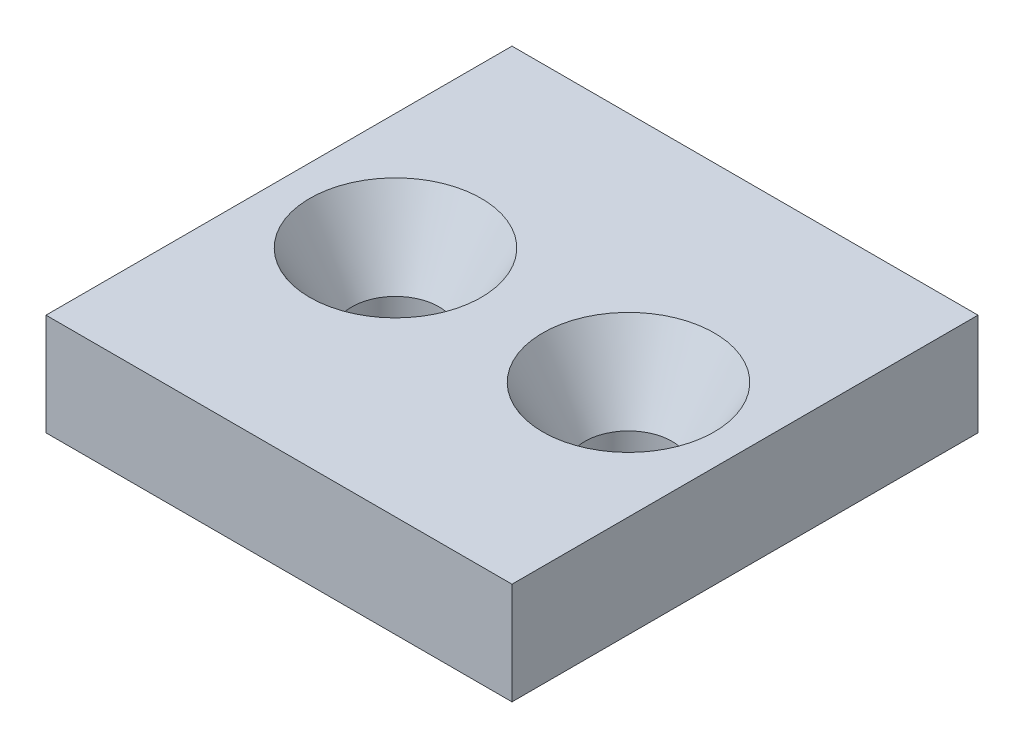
ISO-10303-21;
HEADER;
FILE_DESCRIPTION(('STEP AP214'),'2;1');
FILE_NAME('part.step','',(''),(''),'','','');
FILE_SCHEMA(('AUTOMOTIVE_DESIGN { 1 0 10303 214 1 1 1 1 }'));
ENDSEC;
DATA;
#1=APPLICATION_CONTEXT('core data for automotive mechanical design processes');
#2=APPLICATION_PROTOCOL_DEFINITION('international standard','automotive_design',2000,#1);
#3=PRODUCT_CONTEXT('',#1,'mechanical');
#4=PRODUCT('Part','Part','',(#3));
#5=PRODUCT_RELATED_PRODUCT_CATEGORY('part','',(#4));
#6=PRODUCT_DEFINITION_FORMATION('','',#4);
#7=PRODUCT_DEFINITION_CONTEXT('part definition',#1,'design');
#8=PRODUCT_DEFINITION('design','',#6,#7);
#9=PRODUCT_DEFINITION_SHAPE('','',#8);
#10=(LENGTH_UNIT() NAMED_UNIT(*) SI_UNIT(.MILLI.,.METRE.));
#11=(NAMED_UNIT(*) PLANE_ANGLE_UNIT() SI_UNIT($,.RADIAN.));
#12=(NAMED_UNIT(*) SI_UNIT($,.STERADIAN.) SOLID_ANGLE_UNIT());
#13=UNCERTAINTY_MEASURE_WITH_UNIT(LENGTH_MEASURE(1.E-05),#10,'distance_accuracy_value','');
#14=(GEOMETRIC_REPRESENTATION_CONTEXT(3) GLOBAL_UNCERTAINTY_ASSIGNED_CONTEXT((#13)) GLOBAL_UNIT_ASSIGNED_CONTEXT((#10,
#11,#12)) REPRESENTATION_CONTEXT('',''));
#15=CARTESIAN_POINT('',(0.,0.,0.));
#16=DIRECTION('',(0.,0.,1.));
#17=DIRECTION('',(1.,0.,0.));
#18=AXIS2_PLACEMENT_3D('',#15,#16,#17);
#19=CARTESIAN_POINT('',(16.,7.,16.));
#20=DIRECTION('',(-1.,0.,0.));
#21=DIRECTION('',(0.,0.,1.));
#22=AXIS2_PLACEMENT_3D('',#19,#20,#21);
#23=PLANE('',#22);
#24=DIRECTION('',(0.,0.,-1.));
#25=VECTOR('',#24,1.);
#26=CARTESIAN_POINT('',(16.,0.,16.));
#27=LINE('',#26,#25);
#28=CARTESIAN_POINT('',(16.,0.,16.));
#29=VERTEX_POINT('',#28);
#30=CARTESIAN_POINT('',(16.,0.,-16.));
#31=VERTEX_POINT('',#30);
#32=EDGE_CURVE('E95',#29,#31,#27,.T.);
#33=ORIENTED_EDGE('',*,*,#32,.T.);
#34=DIRECTION('',(0.,-1.,0.));
#35=VECTOR('',#34,1.);
#36=CARTESIAN_POINT('',(16.,7.,-16.));
#37=LINE('',#36,#35);
#38=CARTESIAN_POINT('',(16.,7.,-16.));
#39=VERTEX_POINT('',#38);
#40=EDGE_CURVE('E11',#39,#31,#37,.T.);
#41=ORIENTED_EDGE('',*,*,#40,.F.);
#42=DIRECTION('',(0.,0.,-1.));
#43=VECTOR('',#42,1.);
#44=CARTESIAN_POINT('',(16.,7.,16.));
#45=LINE('',#44,#43);
#46=CARTESIAN_POINT('',(16.,7.,16.));
#47=VERTEX_POINT('',#46);
#48=EDGE_CURVE('E83',#47,#39,#45,.T.);
#49=ORIENTED_EDGE('',*,*,#48,.F.);
#50=DIRECTION('',(0.,-1.,0.));
#51=VECTOR('',#50,1.);
#52=CARTESIAN_POINT('',(16.,7.,16.));
#53=LINE('',#52,#51);
#54=EDGE_CURVE('E91',#47,#29,#53,.T.);
#55=ORIENTED_EDGE('',*,*,#54,.T.);
#56=EDGE_LOOP('',(#33,#41,#49,#55));
#57=FACE_BOUND('',#56,.T.);
#58=ADVANCED_FACE('F32',(#57),#23,.F.);
#59=CARTESIAN_POINT('',(-16.,7.,-16.));
#60=DIRECTION('',(0.,0.,1.));
#61=DIRECTION('',(1.,0.,0.));
#62=AXIS2_PLACEMENT_3D('',#59,#60,#61);
#63=PLANE('',#62);
#64=DIRECTION('',(-1.,0.,0.));
#65=VECTOR('',#64,1.);
#66=CARTESIAN_POINT('',(-16.,0.,-16.));
#67=LINE('',#66,#65);
#68=CARTESIAN_POINT('',(-16.,0.,-16.));
#69=VERTEX_POINT('',#68);
#70=EDGE_CURVE('E87',#31,#69,#67,.T.);
#71=ORIENTED_EDGE('',*,*,#70,.T.);
#72=DIRECTION('',(0.,-1.,0.));
#73=VECTOR('',#72,1.);
#74=CARTESIAN_POINT('',(-16.,7.,-16.));
#75=LINE('',#74,#73);
#76=CARTESIAN_POINT('',(-16.,7.,-16.));
#77=VERTEX_POINT('',#76);
#78=EDGE_CURVE('E40',#77,#69,#75,.T.);
#79=ORIENTED_EDGE('',*,*,#78,.F.);
#80=DIRECTION('',(-1.,0.,0.));
#81=VECTOR('',#80,1.);
#82=CARTESIAN_POINT('',(-16.,7.,-16.));
#83=LINE('',#82,#81);
#84=EDGE_CURVE('E78',#39,#77,#83,.T.);
#85=ORIENTED_EDGE('',*,*,#84,.F.);
#86=ORIENTED_EDGE('',*,*,#40,.T.);
#87=EDGE_LOOP('',(#71,#79,#85,#86));
#88=FACE_BOUND('',#87,.T.);
#89=ADVANCED_FACE('F86',(#88),#63,.F.);
#90=CARTESIAN_POINT('',(-16.,7.,16.));
#91=DIRECTION('',(1.,0.,0.));
#92=DIRECTION('',(0.,0.,-1.));
#93=AXIS2_PLACEMENT_3D('',#90,#91,#92);
#94=PLANE('',#93);
#95=DIRECTION('',(0.,0.,1.));
#96=VECTOR('',#95,1.);
#97=CARTESIAN_POINT('',(-16.,0.,16.));
#98=LINE('',#97,#96);
#99=CARTESIAN_POINT('',(-16.,0.,16.));
#100=VERTEX_POINT('',#99);
#101=EDGE_CURVE('E65',#69,#100,#98,.T.);
#102=ORIENTED_EDGE('',*,*,#101,.T.);
#103=DIRECTION('',(0.,-1.,0.));
#104=VECTOR('',#103,1.);
#105=CARTESIAN_POINT('',(-16.,7.,16.));
#106=LINE('',#105,#104);
#107=CARTESIAN_POINT('',(-16.,7.,16.));
#108=VERTEX_POINT('',#107);
#109=EDGE_CURVE('E88',#108,#100,#106,.T.);
#110=ORIENTED_EDGE('',*,*,#109,.F.);
#111=DIRECTION('',(0.,0.,1.));
#112=VECTOR('',#111,1.);
#113=CARTESIAN_POINT('',(-16.,7.,16.));
#114=LINE('',#113,#112);
#115=EDGE_CURVE('E81',#77,#108,#114,.T.);
#116=ORIENTED_EDGE('',*,*,#115,.F.);
#117=ORIENTED_EDGE('',*,*,#78,.T.);
#118=EDGE_LOOP('',(#102,#110,#116,#117));
#119=FACE_BOUND('',#118,.T.);
#120=ADVANCED_FACE('F89',(#119),#94,.F.);
#121=CARTESIAN_POINT('',(-16.,7.,16.));
#122=DIRECTION('',(0.,0.,-1.));
#123=DIRECTION('',(-1.,0.,0.));
#124=AXIS2_PLACEMENT_3D('',#121,#122,#123);
#125=PLANE('',#124);
#126=DIRECTION('',(1.,0.,0.));
#127=VECTOR('',#126,1.);
#128=CARTESIAN_POINT('',(-16.,0.,16.));
#129=LINE('',#128,#127);
#130=EDGE_CURVE('E71',#100,#29,#129,.T.);
#131=ORIENTED_EDGE('',*,*,#130,.T.);
#132=ORIENTED_EDGE('',*,*,#54,.F.);
#133=DIRECTION('',(1.,0.,0.));
#134=VECTOR('',#133,1.);
#135=CARTESIAN_POINT('',(-16.,7.,16.));
#136=LINE('',#135,#134);
#137=EDGE_CURVE('E48',#108,#47,#136,.T.);
#138=ORIENTED_EDGE('',*,*,#137,.F.);
#139=ORIENTED_EDGE('',*,*,#109,.T.);
#140=EDGE_LOOP('',(#131,#132,#138,#139));
#141=FACE_BOUND('',#140,.T.);
#142=ADVANCED_FACE('F103',(#141),#125,.F.);
#143=CARTESIAN_POINT('',(16.,7.,-16.));
#144=DIRECTION('',(0.,-1.,0.));
#145=DIRECTION('',(0.,0.,-1.));
#146=AXIS2_PLACEMENT_3D('',#143,#144,#145);
#147=PLANE('',#146);
#148=CARTESIAN_POINT('',(-8.,7.,0.));
#149=DIRECTION('',(0.,1.,0.));
#150=DIRECTION('',(0.,0.,1.));
#151=AXIS2_PLACEMENT_3D('',#148,#149,#150);
#152=CIRCLE('',#151,5.89);
#153=CARTESIAN_POINT('',(-8.,7.,5.89));
#154=VERTEX_POINT('',#153);
#155=EDGE_CURVE('E123',#154,#154,#152,.T.);
#156=ORIENTED_EDGE('',*,*,#155,.F.);
#157=EDGE_LOOP('',(#156));
#158=FACE_BOUND('',#157,.T.);
#159=CARTESIAN_POINT('',(8.,7.,0.));
#160=DIRECTION('',(0.,1.,0.));
#161=DIRECTION('',(0.,0.,1.));
#162=AXIS2_PLACEMENT_3D('',#159,#160,#161);
#163=CIRCLE('',#162,5.89);
#164=CARTESIAN_POINT('',(8.,7.,5.89));
#165=VERTEX_POINT('',#164);
#166=EDGE_CURVE('E114',#165,#165,#163,.T.);
#167=ORIENTED_EDGE('',*,*,#166,.F.);
#168=EDGE_LOOP('',(#167));
#169=FACE_BOUND('',#168,.T.);
#170=ORIENTED_EDGE('',*,*,#48,.T.);
#171=ORIENTED_EDGE('',*,*,#84,.T.);
#172=ORIENTED_EDGE('',*,*,#115,.T.);
#173=ORIENTED_EDGE('',*,*,#137,.T.);
#174=EDGE_LOOP('',(#170,#171,#172,#173));
#175=FACE_BOUND('',#174,.T.);
#176=ADVANCED_FACE('F79',(#158,#169,#175),#147,.F.);
#177=CARTESIAN_POINT('',(16.,0.,-16.));
#178=DIRECTION('',(0.,-1.,0.));
#179=DIRECTION('',(0.,0.,-1.));
#180=AXIS2_PLACEMENT_3D('',#177,#178,#179);
#181=PLANE('',#180);
#182=CARTESIAN_POINT('',(-8.,0.,0.));
#183=DIRECTION('',(0.,1.,0.));
#184=DIRECTION('',(0.,0.,1.));
#185=AXIS2_PLACEMENT_3D('',#182,#183,#184);
#186=CIRCLE('',#185,3.);
#187=CARTESIAN_POINT('',(-8.,0.,3.));
#188=VERTEX_POINT('',#187);
#189=EDGE_CURVE('E117',#188,#188,#186,.T.);
#190=ORIENTED_EDGE('',*,*,#189,.T.);
#191=EDGE_LOOP('',(#190));
#192=FACE_BOUND('',#191,.T.);
#193=CARTESIAN_POINT('',(8.,0.,0.));
#194=DIRECTION('',(0.,1.,0.));
#195=DIRECTION('',(0.,0.,1.));
#196=AXIS2_PLACEMENT_3D('',#193,#194,#195);
#197=CIRCLE('',#196,3.);
#198=CARTESIAN_POINT('',(8.,0.,3.));
#199=VERTEX_POINT('',#198);
#200=EDGE_CURVE('E98',#199,#199,#197,.T.);
#201=ORIENTED_EDGE('',*,*,#200,.T.);
#202=EDGE_LOOP('',(#201));
#203=FACE_BOUND('',#202,.T.);
#204=ORIENTED_EDGE('',*,*,#32,.F.);
#205=ORIENTED_EDGE('',*,*,#130,.F.);
#206=ORIENTED_EDGE('',*,*,#101,.F.);
#207=ORIENTED_EDGE('',*,*,#70,.F.);
#208=EDGE_LOOP('',(#204,#205,#206,#207));
#209=FACE_BOUND('',#208,.T.);
#210=ADVANCED_FACE('F106',(#192,#203,#209),#181,.T.);
#211=CARTESIAN_POINT('',(8.,7.,0.));
#212=DIRECTION('',(0.,1.,0.));
#213=DIRECTION('',(0.,0.,1.));
#214=AXIS2_PLACEMENT_3D('',#211,#212,#213);
#215=CYLINDRICAL_SURFACE('',#214,3.);
#216=ORIENTED_EDGE('',*,*,#200,.F.);
#217=EDGE_LOOP('',(#216));
#218=FACE_BOUND('',#217,.T.);
#219=CARTESIAN_POINT('',(8.,1.99437316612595,0.));
#220=DIRECTION('',(0.,1.,0.));
#221=DIRECTION('',(0.,0.,1.));
#222=AXIS2_PLACEMENT_3D('',#219,#220,#221);
#223=CIRCLE('',#222,3.);
#224=CARTESIAN_POINT('',(8.,1.99437316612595,3.));
#225=VERTEX_POINT('',#224);
#226=EDGE_CURVE('E111',#225,#225,#223,.T.);
#227=ORIENTED_EDGE('',*,*,#226,.T.);
#228=EDGE_LOOP('',(#227));
#229=FACE_BOUND('',#228,.T.);
#230=ADVANCED_FACE('F137',(#218,#229),#215,.F.);
#231=CARTESIAN_POINT('',(8.,7.,0.));
#232=DIRECTION('',(0.,1.,0.));
#233=DIRECTION('',(0.,0.,1.));
#234=AXIS2_PLACEMENT_3D('',#231,#232,#233);
#235=CONICAL_SURFACE('',#234,5.89,0.523598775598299);
#236=ORIENTED_EDGE('',*,*,#226,.F.);
#237=EDGE_LOOP('',(#236));
#238=FACE_BOUND('',#237,.T.);
#239=ORIENTED_EDGE('',*,*,#166,.T.);
#240=EDGE_LOOP('',(#239));
#241=FACE_BOUND('',#240,.T.);
#242=ADVANCED_FACE('F134',(#238,#241),#235,.F.);
#243=CARTESIAN_POINT('',(-8.,7.,0.));
#244=DIRECTION('',(0.,1.,0.));
#245=DIRECTION('',(0.,0.,1.));
#246=AXIS2_PLACEMENT_3D('',#243,#244,#245);
#247=CYLINDRICAL_SURFACE('',#246,3.);
#248=ORIENTED_EDGE('',*,*,#189,.F.);
#249=EDGE_LOOP('',(#248));
#250=FACE_BOUND('',#249,.T.);
#251=CARTESIAN_POINT('',(-8.,1.99437316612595,0.));
#252=DIRECTION('',(0.,1.,0.));
#253=DIRECTION('',(0.,0.,1.));
#254=AXIS2_PLACEMENT_3D('',#251,#252,#253);
#255=CIRCLE('',#254,3.);
#256=CARTESIAN_POINT('',(-8.,1.99437316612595,3.));
#257=VERTEX_POINT('',#256);
#258=EDGE_CURVE('E120',#257,#257,#255,.T.);
#259=ORIENTED_EDGE('',*,*,#258,.T.);
#260=EDGE_LOOP('',(#259));
#261=FACE_BOUND('',#260,.T.);
#262=ADVANCED_FACE('F136',(#250,#261),#247,.F.);
#263=CARTESIAN_POINT('',(-8.,7.,0.));
#264=DIRECTION('',(0.,1.,0.));
#265=DIRECTION('',(0.,0.,1.));
#266=AXIS2_PLACEMENT_3D('',#263,#264,#265);
#267=CONICAL_SURFACE('',#266,5.89,0.523598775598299);
#268=ORIENTED_EDGE('',*,*,#258,.F.);
#269=EDGE_LOOP('',(#268));
#270=FACE_BOUND('',#269,.T.);
#271=ORIENTED_EDGE('',*,*,#155,.T.);
#272=EDGE_LOOP('',(#271));
#273=FACE_BOUND('',#272,.T.);
#274=ADVANCED_FACE('F127',(#270,#273),#267,.F.);
#275=CLOSED_SHELL('',(#58,#89,#120,#142,#176,#210,#230,#242,#262,#274));
#276=MANIFOLD_SOLID_BREP('B2',#275);
#277=ADVANCED_BREP_SHAPE_REPRESENTATION('',(#18,#276),#14);
#278=SHAPE_DEFINITION_REPRESENTATION(#9,#277);
ENDSEC;
END-ISO-10303-21;
